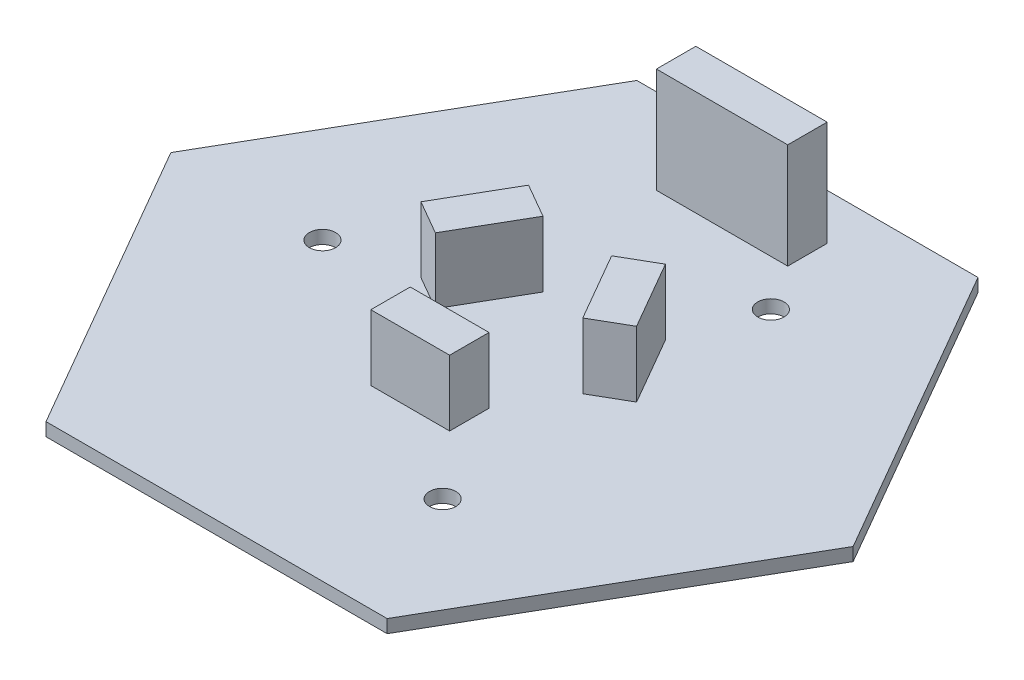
ISO-10303-21;
HEADER;
FILE_DESCRIPTION(('STEP AP214'),'2;1');
FILE_NAME('part.step','',(''),(''),'','','');
FILE_SCHEMA(('AUTOMOTIVE_DESIGN { 1 0 10303 214 1 1 1 1 }'));
ENDSEC;
DATA;
#1=APPLICATION_CONTEXT('core data for automotive mechanical design processes');
#2=APPLICATION_PROTOCOL_DEFINITION('international standard','automotive_design',2000,#1);
#3=PRODUCT_CONTEXT('',#1,'mechanical');
#4=PRODUCT('Part','Part','',(#3));
#5=PRODUCT_RELATED_PRODUCT_CATEGORY('part','',(#4));
#6=PRODUCT_DEFINITION_FORMATION('','',#4);
#7=PRODUCT_DEFINITION_CONTEXT('part definition',#1,'design');
#8=PRODUCT_DEFINITION('design','',#6,#7);
#9=PRODUCT_DEFINITION_SHAPE('','',#8);
#10=(LENGTH_UNIT() NAMED_UNIT(*) SI_UNIT(.MILLI.,.METRE.));
#11=(NAMED_UNIT(*) PLANE_ANGLE_UNIT() SI_UNIT($,.RADIAN.));
#12=(NAMED_UNIT(*) SI_UNIT($,.STERADIAN.) SOLID_ANGLE_UNIT());
#13=UNCERTAINTY_MEASURE_WITH_UNIT(LENGTH_MEASURE(1.E-05),#10,'distance_accuracy_value','');
#14=(GEOMETRIC_REPRESENTATION_CONTEXT(3) GLOBAL_UNCERTAINTY_ASSIGNED_CONTEXT((#13)) GLOBAL_UNIT_ASSIGNED_CONTEXT((#10,
#11,#12)) REPRESENTATION_CONTEXT('',''));
#15=CARTESIAN_POINT('',(0.,0.,0.));
#16=DIRECTION('',(0.,0.,1.));
#17=DIRECTION('',(1.,0.,0.));
#18=AXIS2_PLACEMENT_3D('',#15,#16,#17);
#19=CARTESIAN_POINT('',(0.,1.,0.));
#20=DIRECTION('',(0.,1.,0.));
#21=DIRECTION('',(0.,0.,1.));
#22=AXIS2_PLACEMENT_3D('',#19,#20,#21);
#23=PLANE('',#22);
#24=CARTESIAN_POINT('',(7.21687836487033,1.,12.5));
#25=DIRECTION('',(0.,1.,0.));
#26=DIRECTION('',(0.,0.,1.));
#27=AXIS2_PLACEMENT_3D('',#24,#25,#26);
#28=CIRCLE('',#27,0.999999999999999);
#29=CARTESIAN_POINT('',(7.21687836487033,1.,13.5));
#30=VERTEX_POINT('',#29);
#31=EDGE_CURVE('E356',#30,#30,#28,.T.);
#32=ORIENTED_EDGE('',*,*,#31,.F.);
#33=EDGE_LOOP('',(#32));
#34=FACE_BOUND('',#33,.T.);
#35=DIRECTION('',(0.499999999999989,0.,-0.866025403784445));
#36=VECTOR('',#35,1.);
#37=CARTESIAN_POINT('',(22.4855715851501,1.,6.05384757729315));
#38=LINE('',#37,#36);
#39=CARTESIAN_POINT('',(12.9903810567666,1.,22.5));
#40=VERTEX_POINT('',#39);
#41=CARTESIAN_POINT('',(25.9807621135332,1.,0.));
#42=VERTEX_POINT('',#41);
#43=EDGE_CURVE('E372',#40,#42,#38,.T.);
#44=ORIENTED_EDGE('',*,*,#43,.T.);
#45=DIRECTION('',(-0.5,0.,-0.866025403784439));
#46=VECTOR('',#45,1.);
#47=CARTESIAN_POINT('',(25.9807621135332,1.,0.));
#48=LINE('',#47,#46);
#49=CARTESIAN_POINT('',(12.9903810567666,1.,-22.5));
#50=VERTEX_POINT('',#49);
#51=EDGE_CURVE('E376',#42,#50,#48,.T.);
#52=ORIENTED_EDGE('',*,*,#51,.T.);
#53=DIRECTION('',(-1.,0.,0.));
#54=VECTOR('',#53,1.);
#55=CARTESIAN_POINT('',(12.9903810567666,1.,-22.5));
#56=LINE('',#55,#54);
#57=CARTESIAN_POINT('',(-12.9903810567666,1.,-22.5));
#58=VERTEX_POINT('',#57);
#59=EDGE_CURVE('E380',#50,#58,#56,.T.);
#60=ORIENTED_EDGE('',*,*,#59,.T.);
#61=DIRECTION('',(-0.5,0.,0.866025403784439));
#62=VECTOR('',#61,1.);
#63=CARTESIAN_POINT('',(-12.9903810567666,1.,-22.5));
#64=LINE('',#63,#62);
#65=CARTESIAN_POINT('',(-25.9807621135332,1.,0.));
#66=VERTEX_POINT('',#65);
#67=EDGE_CURVE('E383',#58,#66,#64,.T.);
#68=ORIENTED_EDGE('',*,*,#67,.T.);
#69=DIRECTION('',(0.50000000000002,0.,0.866025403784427));
#70=VECTOR('',#69,1.);
#71=CARTESIAN_POINT('',(-25.9807621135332,1.,0.));
#72=LINE('',#71,#70);
#73=CARTESIAN_POINT('',(-12.9903810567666,1.,22.5));
#74=VERTEX_POINT('',#73);
#75=EDGE_CURVE('E386',#66,#74,#72,.T.);
#76=ORIENTED_EDGE('',*,*,#75,.T.);
#77=DIRECTION('',(1.,0.,0.));
#78=VECTOR('',#77,1.);
#79=CARTESIAN_POINT('',(-12.9903810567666,1.,22.5));
#80=LINE('',#79,#78);
#81=EDGE_CURVE('E389',#74,#40,#80,.T.);
#82=ORIENTED_EDGE('',*,*,#81,.T.);
#83=EDGE_LOOP('',(#44,#52,#60,#68,#76,#82));
#84=FACE_BOUND('',#83,.T.);
#85=CARTESIAN_POINT('',(7.21687836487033,1.,-12.5));
#86=DIRECTION('',(0.,1.,0.));
#87=DIRECTION('',(0.,0.,1.));
#88=AXIS2_PLACEMENT_3D('',#85,#86,#87);
#89=CIRCLE('',#88,0.999999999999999);
#90=CARTESIAN_POINT('',(7.21687836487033,1.,-11.5));
#91=VERTEX_POINT('',#90);
#92=EDGE_CURVE('E364',#91,#91,#89,.T.);
#93=ORIENTED_EDGE('',*,*,#92,.F.);
#94=EDGE_LOOP('',(#93));
#95=FACE_BOUND('',#94,.T.);
#96=CARTESIAN_POINT('',(-14.4337567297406,1.,0.));
#97=DIRECTION('',(0.,1.,0.));
#98=DIRECTION('',(0.,0.,1.));
#99=AXIS2_PLACEMENT_3D('',#96,#97,#98);
#100=CIRCLE('',#99,1.);
#101=CARTESIAN_POINT('',(-14.4337567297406,1.,0.999999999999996));
#102=VERTEX_POINT('',#101);
#103=EDGE_CURVE('E348',#102,#102,#100,.T.);
#104=ORIENTED_EDGE('',*,*,#103,.F.);
#105=EDGE_LOOP('',(#104));
#106=FACE_BOUND('',#105,.T.);
#107=DIRECTION('',(-0.5,0.,-0.866025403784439));
#108=VECTOR('',#107,1.);
#109=CARTESIAN_POINT('',(8.21169687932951,1.,-1.27692378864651));
#110=LINE('',#109,#108);
#111=CARTESIAN_POINT('',(8.21169687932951,1.,-1.27692378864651));
#112=VERTEX_POINT('',#111);
#113=CARTESIAN_POINT('',(5.21169687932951,1.,-6.47307621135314));
#114=VERTEX_POINT('',#113);
#115=EDGE_CURVE('E325',#112,#114,#110,.T.);
#116=ORIENTED_EDGE('',*,*,#115,.F.);
#117=DIRECTION('',(0.866025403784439,0.,-0.5));
#118=VECTOR('',#117,1.);
#119=CARTESIAN_POINT('',(5.61362066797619,1.,0.223076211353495));
#120=LINE('',#119,#118);
#121=CARTESIAN_POINT('',(5.61362066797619,1.,0.223076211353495));
#122=VERTEX_POINT('',#121);
#123=EDGE_CURVE('E306',#122,#112,#120,.T.);
#124=ORIENTED_EDGE('',*,*,#123,.F.);
#125=DIRECTION('',(0.499999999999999,0.,0.866025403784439));
#126=VECTOR('',#125,1.);
#127=CARTESIAN_POINT('',(5.61362066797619,1.,0.223076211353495));
#128=LINE('',#127,#126);
#129=CARTESIAN_POINT('',(2.6136206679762,1.,-4.97307621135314));
#130=VERTEX_POINT('',#129);
#131=EDGE_CURVE('E312',#130,#122,#128,.T.);
#132=ORIENTED_EDGE('',*,*,#131,.F.);
#133=DIRECTION('',(-0.866025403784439,0.,0.5));
#134=VECTOR('',#133,1.);
#135=CARTESIAN_POINT('',(2.6136206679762,1.,-4.97307621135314));
#136=LINE('',#135,#134);
#137=EDGE_CURVE('E328',#114,#130,#136,.T.);
#138=ORIENTED_EDGE('',*,*,#137,.F.);
#139=EDGE_LOOP('',(#116,#124,#132,#138));
#140=FACE_BOUND('',#139,.T.);
#141=DIRECTION('',(0.,0.,1.));
#142=VECTOR('',#141,1.);
#143=CARTESIAN_POINT('',(-3.00000000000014,1.,4.75000000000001));
#144=LINE('',#143,#142);
#145=CARTESIAN_POINT('',(-3.00000000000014,1.,4.75000000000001));
#146=VERTEX_POINT('',#145);
#147=CARTESIAN_POINT('',(-3.00000000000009,1.,7.75000000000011));
#148=VERTEX_POINT('',#147);
#149=EDGE_CURVE('E284',#146,#148,#144,.T.);
#150=ORIENTED_EDGE('',*,*,#149,.F.);
#151=DIRECTION('',(-1.,0.,0.));
#152=VECTOR('',#151,1.);
#153=CARTESIAN_POINT('',(-3.00000000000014,1.,4.75000000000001));
#154=LINE('',#153,#152);
#155=CARTESIAN_POINT('',(2.99999999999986,1.,4.75000000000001));
#156=VERTEX_POINT('',#155);
#157=EDGE_CURVE('E265',#156,#146,#154,.T.);
#158=ORIENTED_EDGE('',*,*,#157,.F.);
#159=DIRECTION('',(0.,0.,-1.));
#160=VECTOR('',#159,1.);
#161=CARTESIAN_POINT('',(2.99999999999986,1.,4.75000000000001));
#162=LINE('',#161,#160);
#163=CARTESIAN_POINT('',(2.99999999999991,1.,7.75000000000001));
#164=VERTEX_POINT('',#163);
#165=EDGE_CURVE('E271',#164,#156,#162,.T.);
#166=ORIENTED_EDGE('',*,*,#165,.F.);
#167=DIRECTION('',(1.,0.,0.));
#168=VECTOR('',#167,1.);
#169=CARTESIAN_POINT('',(-3.00000000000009,1.,7.75000000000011));
#170=LINE('',#169,#168);
#171=EDGE_CURVE('E287',#148,#164,#170,.T.);
#172=ORIENTED_EDGE('',*,*,#171,.F.);
#173=EDGE_LOOP('',(#150,#158,#166,#172));
#174=FACE_BOUND('',#173,.T.);
#175=DIRECTION('',(-0.866025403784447,0.,-0.499999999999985));
#176=VECTOR('',#175,1.);
#177=CARTESIAN_POINT('',(-2.61362066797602,1.,-4.97307621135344));
#178=LINE('',#177,#176);
#179=CARTESIAN_POINT('',(-2.61362066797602,1.,-4.97307621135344));
#180=VERTEX_POINT('',#179);
#181=CARTESIAN_POINT('',(-5.21169687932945,1.,-6.47307621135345));
#182=VERTEX_POINT('',#181);
#183=EDGE_CURVE('E223',#180,#182,#178,.T.);
#184=ORIENTED_EDGE('',*,*,#183,.F.);
#185=DIRECTION('',(0.499999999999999,0.,-0.866025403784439));
#186=VECTOR('',#185,1.);
#187=CARTESIAN_POINT('',(-2.61362066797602,1.,-4.97307621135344));
#188=LINE('',#187,#186);
#189=CARTESIAN_POINT('',(-5.61362066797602,1.,0.223076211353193));
#190=VERTEX_POINT('',#189);
#191=EDGE_CURVE('E218',#190,#180,#188,.T.);
#192=ORIENTED_EDGE('',*,*,#191,.F.);
#193=DIRECTION('',(0.866025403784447,0.,0.499999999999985));
#194=VECTOR('',#193,1.);
#195=CARTESIAN_POINT('',(-5.61362066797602,1.,0.223076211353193));
#196=LINE('',#195,#194);
#197=CARTESIAN_POINT('',(-8.21169687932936,1.,-1.27692378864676));
#198=VERTEX_POINT('',#197);
#199=EDGE_CURVE('E234',#198,#190,#196,.T.);
#200=ORIENTED_EDGE('',*,*,#199,.F.);
#201=DIRECTION('',(-0.499999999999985,0.,0.866025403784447));
#202=VECTOR('',#201,1.);
#203=CARTESIAN_POINT('',(-5.21169687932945,1.,-6.47307621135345));
#204=LINE('',#203,#202);
#205=EDGE_CURVE('E246',#182,#198,#204,.T.);
#206=ORIENTED_EDGE('',*,*,#205,.F.);
#207=EDGE_LOOP('',(#184,#192,#200,#206));
#208=FACE_BOUND('',#207,.T.);
#209=DIRECTION('',(1.,0.,0.));
#210=VECTOR('',#209,1.);
#211=CARTESIAN_POINT('',(0.,1.,-16.));
#212=LINE('',#211,#210);
#213=CARTESIAN_POINT('',(-5.,1.,-16.));
#214=VERTEX_POINT('',#213);
#215=CARTESIAN_POINT('',(5.,1.,-16.));
#216=VERTEX_POINT('',#215);
#217=EDGE_CURVE('E59',#214,#216,#212,.T.);
#218=ORIENTED_EDGE('',*,*,#217,.F.);
#219=DIRECTION('',(0.,0.,1.));
#220=VECTOR('',#219,1.);
#221=CARTESIAN_POINT('',(-5.,1.,0.));
#222=LINE('',#221,#220);
#223=CARTESIAN_POINT('',(-5.,1.,-19.));
#224=VERTEX_POINT('',#223);
#225=EDGE_CURVE('E216',#224,#214,#222,.T.);
#226=ORIENTED_EDGE('',*,*,#225,.F.);
#227=DIRECTION('',(1.,0.,0.));
#228=VECTOR('',#227,1.);
#229=CARTESIAN_POINT('',(0.,1.,-19.));
#230=LINE('',#229,#228);
#231=CARTESIAN_POINT('',(5.,1.,-19.));
#232=VERTEX_POINT('',#231);
#233=EDGE_CURVE('E213',#224,#232,#230,.T.);
#234=ORIENTED_EDGE('',*,*,#233,.T.);
#235=DIRECTION('',(0.,0.,1.));
#236=VECTOR('',#235,1.);
#237=CARTESIAN_POINT('',(5.00000000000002,1.,0.));
#238=LINE('',#237,#236);
#239=EDGE_CURVE('E64',#232,#216,#238,.T.);
#240=ORIENTED_EDGE('',*,*,#239,.T.);
#241=EDGE_LOOP('',(#218,#226,#234,#240));
#242=FACE_BOUND('',#241,.T.);
#243=ADVANCED_FACE('F43',(#34,#84,#95,#106,#140,#174,#208,#242),#23,.T.);
#244=CARTESIAN_POINT('',(0.,0.,0.));
#245=DIRECTION('',(0.,1.,0.));
#246=DIRECTION('',(0.,0.,1.));
#247=AXIS2_PLACEMENT_3D('',#244,#245,#246);
#248=PLANE('',#247);
#249=DIRECTION('',(-0.5,0.,-0.866025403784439));
#250=VECTOR('',#249,1.);
#251=CARTESIAN_POINT('',(25.9807621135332,0.,0.));
#252=LINE('',#251,#250);
#253=CARTESIAN_POINT('',(25.9807621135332,0.,0.));
#254=VERTEX_POINT('',#253);
#255=CARTESIAN_POINT('',(12.9903810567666,0.,-22.5));
#256=VERTEX_POINT('',#255);
#257=EDGE_CURVE('E368',#254,#256,#252,.T.);
#258=ORIENTED_EDGE('',*,*,#257,.F.);
#259=DIRECTION('',(0.500000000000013,0.,-0.866025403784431));
#260=VECTOR('',#259,1.);
#261=CARTESIAN_POINT('',(19.4855715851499,0.,11.25));
#262=LINE('',#261,#260);
#263=CARTESIAN_POINT('',(12.9903810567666,0.,22.5));
#264=VERTEX_POINT('',#263);
#265=EDGE_CURVE('E377',#264,#254,#262,.T.);
#266=ORIENTED_EDGE('',*,*,#265,.F.);
#267=DIRECTION('',(1.,0.,0.));
#268=VECTOR('',#267,1.);
#269=CARTESIAN_POINT('',(-12.9903810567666,0.,22.5));
#270=LINE('',#269,#268);
#271=CARTESIAN_POINT('',(-12.9903810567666,0.,22.5));
#272=VERTEX_POINT('',#271);
#273=EDGE_CURVE('E407',#272,#264,#270,.T.);
#274=ORIENTED_EDGE('',*,*,#273,.F.);
#275=DIRECTION('',(0.499999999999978,0.,0.866025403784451));
#276=VECTOR('',#275,1.);
#277=CARTESIAN_POINT('',(-16.4855715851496,0.,16.4461524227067));
#278=LINE('',#277,#276);
#279=CARTESIAN_POINT('',(-25.9807621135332,0.,0.));
#280=VERTEX_POINT('',#279);
#281=EDGE_CURVE('E404',#280,#272,#278,.T.);
#282=ORIENTED_EDGE('',*,*,#281,.F.);
#283=DIRECTION('',(-0.5,0.,0.866025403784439));
#284=VECTOR('',#283,1.);
#285=CARTESIAN_POINT('',(-12.9903810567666,0.,-22.5));
#286=LINE('',#285,#284);
#287=CARTESIAN_POINT('',(-12.9903810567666,0.,-22.5));
#288=VERTEX_POINT('',#287);
#289=EDGE_CURVE('E400',#288,#280,#286,.T.);
#290=ORIENTED_EDGE('',*,*,#289,.F.);
#291=DIRECTION('',(-1.,0.,0.));
#292=VECTOR('',#291,1.);
#293=CARTESIAN_POINT('',(-6.,0.,-22.5));
#294=LINE('',#293,#292);
#295=EDGE_CURVE('E397',#256,#288,#294,.T.);
#296=ORIENTED_EDGE('',*,*,#295,.F.);
#297=EDGE_LOOP('',(#258,#266,#274,#282,#290,#296));
#298=FACE_BOUND('',#297,.T.);
#299=CARTESIAN_POINT('',(7.21687836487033,0.,-12.5));
#300=DIRECTION('',(0.,1.,0.));
#301=DIRECTION('',(0.,0.,1.));
#302=AXIS2_PLACEMENT_3D('',#299,#300,#301);
#303=CIRCLE('',#302,0.999999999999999);
#304=CARTESIAN_POINT('',(7.21687836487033,0.,-11.5));
#305=VERTEX_POINT('',#304);
#306=EDGE_CURVE('E360',#305,#305,#303,.T.);
#307=ORIENTED_EDGE('',*,*,#306,.T.);
#308=EDGE_LOOP('',(#307));
#309=FACE_BOUND('',#308,.T.);
#310=CARTESIAN_POINT('',(7.21687836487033,0.,12.5));
#311=DIRECTION('',(0.,1.,0.));
#312=DIRECTION('',(0.,0.,1.));
#313=AXIS2_PLACEMENT_3D('',#310,#311,#312);
#314=CIRCLE('',#313,0.999999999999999);
#315=CARTESIAN_POINT('',(7.21687836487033,0.,13.5));
#316=VERTEX_POINT('',#315);
#317=EDGE_CURVE('E352',#316,#316,#314,.T.);
#318=ORIENTED_EDGE('',*,*,#317,.T.);
#319=EDGE_LOOP('',(#318));
#320=FACE_BOUND('',#319,.T.);
#321=CARTESIAN_POINT('',(-14.4337567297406,0.,0.));
#322=DIRECTION('',(0.,1.,0.));
#323=DIRECTION('',(0.,0.,1.));
#324=AXIS2_PLACEMENT_3D('',#321,#322,#323);
#325=CIRCLE('',#324,1.);
#326=CARTESIAN_POINT('',(-14.4337567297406,0.,0.999999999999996));
#327=VERTEX_POINT('',#326);
#328=EDGE_CURVE('E347',#327,#327,#325,.T.);
#329=ORIENTED_EDGE('',*,*,#328,.T.);
#330=EDGE_LOOP('',(#329));
#331=FACE_BOUND('',#330,.T.);
#332=ADVANCED_FACE('F438',(#298,#309,#320,#331),#248,.F.);
#333=CARTESIAN_POINT('',(25.9807621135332,1.,0.));
#334=DIRECTION('',(-0.866025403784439,0.,0.5));
#335=DIRECTION('',(0.5,0.,0.866025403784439));
#336=AXIS2_PLACEMENT_3D('',#333,#334,#335);
#337=PLANE('',#336);
#338=ORIENTED_EDGE('',*,*,#257,.T.);
#339=DIRECTION('',(0.,-1.,0.));
#340=VECTOR('',#339,1.);
#341=CARTESIAN_POINT('',(12.9903810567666,1.,-22.5));
#342=LINE('',#341,#340);
#343=EDGE_CURVE('E52',#50,#256,#342,.T.);
#344=ORIENTED_EDGE('',*,*,#343,.F.);
#345=ORIENTED_EDGE('',*,*,#51,.F.);
#346=DIRECTION('',(0.,-1.,0.));
#347=VECTOR('',#346,1.);
#348=CARTESIAN_POINT('',(25.9807621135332,1.,0.));
#349=LINE('',#348,#347);
#350=EDGE_CURVE('E11',#42,#254,#349,.T.);
#351=ORIENTED_EDGE('',*,*,#350,.T.);
#352=EDGE_LOOP('',(#338,#344,#345,#351));
#353=FACE_BOUND('',#352,.T.);
#354=ADVANCED_FACE('F45',(#353),#337,.F.);
#355=CARTESIAN_POINT('',(-6.,1.,-22.5));
#356=DIRECTION('',(0.,0.,1.));
#357=DIRECTION('',(1.,0.,0.));
#358=AXIS2_PLACEMENT_3D('',#355,#356,#357);
#359=PLANE('',#358);
#360=ORIENTED_EDGE('',*,*,#295,.T.);
#361=DIRECTION('',(0.,-1.,0.));
#362=VECTOR('',#361,1.);
#363=CARTESIAN_POINT('',(-12.9903810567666,1.,-22.5));
#364=LINE('',#363,#362);
#365=EDGE_CURVE('E424',#58,#288,#364,.T.);
#366=ORIENTED_EDGE('',*,*,#365,.F.);
#367=ORIENTED_EDGE('',*,*,#59,.F.);
#368=ORIENTED_EDGE('',*,*,#343,.T.);
#369=EDGE_LOOP('',(#360,#366,#367,#368));
#370=FACE_BOUND('',#369,.T.);
#371=ADVANCED_FACE('F432',(#370),#359,.F.);
#372=CARTESIAN_POINT('',(-12.9903810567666,1.,-22.5));
#373=DIRECTION('',(0.866025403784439,0.,0.5));
#374=DIRECTION('',(0.5,0.,-0.866025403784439));
#375=AXIS2_PLACEMENT_3D('',#372,#373,#374);
#376=PLANE('',#375);
#377=ORIENTED_EDGE('',*,*,#289,.T.);
#378=DIRECTION('',(0.,-1.,0.));
#379=VECTOR('',#378,1.);
#380=CARTESIAN_POINT('',(-25.9807621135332,1.,0.));
#381=LINE('',#380,#379);
#382=EDGE_CURVE('E420',#66,#280,#381,.T.);
#383=ORIENTED_EDGE('',*,*,#382,.F.);
#384=ORIENTED_EDGE('',*,*,#67,.F.);
#385=ORIENTED_EDGE('',*,*,#365,.T.);
#386=EDGE_LOOP('',(#377,#383,#384,#385));
#387=FACE_BOUND('',#386,.T.);
#388=ADVANCED_FACE('F444',(#387),#376,.F.);
#389=CARTESIAN_POINT('',(-16.4855715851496,1.,16.4461524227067));
#390=DIRECTION('',(0.866025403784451,0.,-0.499999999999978));
#391=DIRECTION('',(-0.499999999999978,0.,-0.866025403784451));
#392=AXIS2_PLACEMENT_3D('',#389,#390,#391);
#393=PLANE('',#392);
#394=ORIENTED_EDGE('',*,*,#281,.T.);
#395=DIRECTION('',(0.,-1.,0.));
#396=VECTOR('',#395,1.);
#397=CARTESIAN_POINT('',(-12.9903810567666,1.,22.5));
#398=LINE('',#397,#396);
#399=EDGE_CURVE('E416',#74,#272,#398,.T.);
#400=ORIENTED_EDGE('',*,*,#399,.F.);
#401=ORIENTED_EDGE('',*,*,#75,.F.);
#402=ORIENTED_EDGE('',*,*,#382,.T.);
#403=EDGE_LOOP('',(#394,#400,#401,#402));
#404=FACE_BOUND('',#403,.T.);
#405=ADVANCED_FACE('F448',(#404),#393,.F.);
#406=CARTESIAN_POINT('',(-12.9903810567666,1.,22.5));
#407=DIRECTION('',(0.,0.,-1.));
#408=DIRECTION('',(-1.,0.,0.));
#409=AXIS2_PLACEMENT_3D('',#406,#407,#408);
#410=PLANE('',#409);
#411=ORIENTED_EDGE('',*,*,#273,.T.);
#412=DIRECTION('',(0.,-1.,0.));
#413=VECTOR('',#412,1.);
#414=CARTESIAN_POINT('',(12.9903810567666,1.,22.5));
#415=LINE('',#414,#413);
#416=EDGE_CURVE('E393',#40,#264,#415,.T.);
#417=ORIENTED_EDGE('',*,*,#416,.F.);
#418=ORIENTED_EDGE('',*,*,#81,.F.);
#419=ORIENTED_EDGE('',*,*,#399,.T.);
#420=EDGE_LOOP('',(#411,#417,#418,#419));
#421=FACE_BOUND('',#420,.T.);
#422=ADVANCED_FACE('F457',(#421),#410,.F.);
#423=CARTESIAN_POINT('',(19.4855715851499,1.,11.25));
#424=DIRECTION('',(-0.866025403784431,0.,-0.500000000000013));
#425=DIRECTION('',(-0.500000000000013,0.,0.866025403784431));
#426=AXIS2_PLACEMENT_3D('',#423,#424,#425);
#427=PLANE('',#426);
#428=ORIENTED_EDGE('',*,*,#265,.T.);
#429=ORIENTED_EDGE('',*,*,#350,.F.);
#430=ORIENTED_EDGE('',*,*,#43,.F.);
#431=ORIENTED_EDGE('',*,*,#416,.T.);
#432=EDGE_LOOP('',(#428,#429,#430,#431));
#433=FACE_BOUND('',#432,.T.);
#434=ADVANCED_FACE('F455',(#433),#427,.F.);
#435=CARTESIAN_POINT('',(7.21687836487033,1.,-12.5));
#436=DIRECTION('',(0.,-1.,0.));
#437=DIRECTION('',(0.,0.,-1.));
#438=AXIS2_PLACEMENT_3D('',#435,#436,#437);
#439=CYLINDRICAL_SURFACE('',#438,0.999999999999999);
#440=ORIENTED_EDGE('',*,*,#92,.T.);
#441=EDGE_LOOP('',(#440));
#442=FACE_BOUND('',#441,.T.);
#443=ORIENTED_EDGE('',*,*,#306,.F.);
#444=EDGE_LOOP('',(#443));
#445=FACE_BOUND('',#444,.T.);
#446=ADVANCED_FACE('F464',(#442,#445),#439,.F.);
#447=CARTESIAN_POINT('',(7.21687836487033,1.,12.5));
#448=DIRECTION('',(0.,-1.,0.));
#449=DIRECTION('',(0.,0.,-1.));
#450=AXIS2_PLACEMENT_3D('',#447,#448,#449);
#451=CYLINDRICAL_SURFACE('',#450,0.999999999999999);
#452=ORIENTED_EDGE('',*,*,#31,.T.);
#453=EDGE_LOOP('',(#452));
#454=FACE_BOUND('',#453,.T.);
#455=ORIENTED_EDGE('',*,*,#317,.F.);
#456=EDGE_LOOP('',(#455));
#457=FACE_BOUND('',#456,.T.);
#458=ADVANCED_FACE('F478',(#454,#457),#451,.F.);
#459=CARTESIAN_POINT('',(-14.4337567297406,1.,0.));
#460=DIRECTION('',(0.,-1.,0.));
#461=DIRECTION('',(0.,0.,-1.));
#462=AXIS2_PLACEMENT_3D('',#459,#460,#461);
#463=CYLINDRICAL_SURFACE('',#462,1.);
#464=ORIENTED_EDGE('',*,*,#103,.T.);
#465=EDGE_LOOP('',(#464));
#466=FACE_BOUND('',#465,.T.);
#467=ORIENTED_EDGE('',*,*,#328,.F.);
#468=EDGE_LOOP('',(#467));
#469=FACE_BOUND('',#468,.T.);
#470=ADVANCED_FACE('F482',(#466,#469),#463,.F.);
#471=CARTESIAN_POINT('',(5.61362066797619,6.,0.223076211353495));
#472=DIRECTION('',(-0.5,0.,-0.866025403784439));
#473=DIRECTION('',(-0.866025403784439,0.,0.5));
#474=AXIS2_PLACEMENT_3D('',#471,#472,#473);
#475=PLANE('',#474);
#476=ORIENTED_EDGE('',*,*,#123,.T.);
#477=DIRECTION('',(0.,-1.,0.));
#478=VECTOR('',#477,1.);
#479=CARTESIAN_POINT('',(8.21169687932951,6.,-1.27692378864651));
#480=LINE('',#479,#478);
#481=CARTESIAN_POINT('',(8.21169687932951,6.,-1.27692378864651));
#482=VERTEX_POINT('',#481);
#483=EDGE_CURVE('E344',#482,#112,#480,.T.);
#484=ORIENTED_EDGE('',*,*,#483,.F.);
#485=DIRECTION('',(0.866025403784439,0.,-0.5));
#486=VECTOR('',#485,1.);
#487=CARTESIAN_POINT('',(5.61362066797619,6.,0.223076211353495));
#488=LINE('',#487,#486);
#489=CARTESIAN_POINT('',(5.61362066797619,6.,0.223076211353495));
#490=VERTEX_POINT('',#489);
#491=EDGE_CURVE('E307',#490,#482,#488,.T.);
#492=ORIENTED_EDGE('',*,*,#491,.F.);
#493=DIRECTION('',(0.,-1.,0.));
#494=VECTOR('',#493,1.);
#495=CARTESIAN_POINT('',(5.61362066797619,6.,0.223076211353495));
#496=LINE('',#495,#494);
#497=EDGE_CURVE('E321',#490,#122,#496,.T.);
#498=ORIENTED_EDGE('',*,*,#497,.T.);
#499=EDGE_LOOP('',(#476,#484,#492,#498));
#500=FACE_BOUND('',#499,.T.);
#501=ADVANCED_FACE('F486',(#500),#475,.F.);
#502=CARTESIAN_POINT('',(8.21169687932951,6.,-1.27692378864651));
#503=DIRECTION('',(-0.866025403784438,0.,0.5));
#504=DIRECTION('',(0.5,0.,0.866025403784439));
#505=AXIS2_PLACEMENT_3D('',#502,#503,#504);
#506=PLANE('',#505);
#507=ORIENTED_EDGE('',*,*,#115,.T.);
#508=DIRECTION('',(0.,-1.,0.));
#509=VECTOR('',#508,1.);
#510=CARTESIAN_POINT('',(5.21169687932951,6.,-6.47307621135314));
#511=LINE('',#510,#509);
#512=CARTESIAN_POINT('',(5.21169687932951,6.,-6.47307621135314));
#513=VERTEX_POINT('',#512);
#514=EDGE_CURVE('E340',#513,#114,#511,.T.);
#515=ORIENTED_EDGE('',*,*,#514,.F.);
#516=DIRECTION('',(-0.5,0.,-0.866025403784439));
#517=VECTOR('',#516,1.);
#518=CARTESIAN_POINT('',(8.21169687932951,6.,-1.27692378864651));
#519=LINE('',#518,#517);
#520=EDGE_CURVE('E311',#482,#513,#519,.T.);
#521=ORIENTED_EDGE('',*,*,#520,.F.);
#522=ORIENTED_EDGE('',*,*,#483,.T.);
#523=EDGE_LOOP('',(#507,#515,#521,#522));
#524=FACE_BOUND('',#523,.T.);
#525=ADVANCED_FACE('F490',(#524),#506,.F.);
#526=CARTESIAN_POINT('',(2.6136206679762,6.,-4.97307621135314));
#527=DIRECTION('',(0.5,0.,0.866025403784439));
#528=DIRECTION('',(0.866025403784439,0.,-0.5));
#529=AXIS2_PLACEMENT_3D('',#526,#527,#528);
#530=PLANE('',#529);
#531=ORIENTED_EDGE('',*,*,#137,.T.);
#532=DIRECTION('',(0.,-1.,0.));
#533=VECTOR('',#532,1.);
#534=CARTESIAN_POINT('',(2.6136206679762,6.,-4.97307621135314));
#535=LINE('',#534,#533);
#536=CARTESIAN_POINT('',(2.6136206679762,6.,-4.97307621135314));
#537=VERTEX_POINT('',#536);
#538=EDGE_CURVE('E337',#537,#130,#535,.T.);
#539=ORIENTED_EDGE('',*,*,#538,.F.);
#540=DIRECTION('',(-0.866025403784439,0.,0.5));
#541=VECTOR('',#540,1.);
#542=CARTESIAN_POINT('',(2.6136206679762,6.,-4.97307621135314));
#543=LINE('',#542,#541);
#544=EDGE_CURVE('E315',#513,#537,#543,.T.);
#545=ORIENTED_EDGE('',*,*,#544,.F.);
#546=ORIENTED_EDGE('',*,*,#514,.T.);
#547=EDGE_LOOP('',(#531,#539,#545,#546));
#548=FACE_BOUND('',#547,.T.);
#549=ADVANCED_FACE('F494',(#548),#530,.F.);
#550=CARTESIAN_POINT('',(5.61362066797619,6.,0.223076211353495));
#551=DIRECTION('',(0.866025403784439,0.,-0.499999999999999));
#552=DIRECTION('',(-0.499999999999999,0.,-0.866025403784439));
#553=AXIS2_PLACEMENT_3D('',#550,#551,#552);
#554=PLANE('',#553);
#555=ORIENTED_EDGE('',*,*,#131,.T.);
#556=ORIENTED_EDGE('',*,*,#497,.F.);
#557=DIRECTION('',(0.499999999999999,0.,0.866025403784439));
#558=VECTOR('',#557,1.);
#559=CARTESIAN_POINT('',(5.61362066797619,6.,0.223076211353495));
#560=LINE('',#559,#558);
#561=EDGE_CURVE('E318',#537,#490,#560,.T.);
#562=ORIENTED_EDGE('',*,*,#561,.F.);
#563=ORIENTED_EDGE('',*,*,#538,.T.);
#564=EDGE_LOOP('',(#555,#556,#562,#563));
#565=FACE_BOUND('',#564,.T.);
#566=ADVANCED_FACE('F498',(#565),#554,.F.);
#567=CARTESIAN_POINT('',(0.,6.,0.));
#568=DIRECTION('',(0.,1.,0.));
#569=DIRECTION('',(0.,0.,1.));
#570=AXIS2_PLACEMENT_3D('',#567,#568,#569);
#571=PLANE('',#570);
#572=ORIENTED_EDGE('',*,*,#491,.T.);
#573=ORIENTED_EDGE('',*,*,#520,.T.);
#574=ORIENTED_EDGE('',*,*,#544,.T.);
#575=ORIENTED_EDGE('',*,*,#561,.T.);
#576=EDGE_LOOP('',(#572,#573,#574,#575));
#577=FACE_BOUND('',#576,.T.);
#578=ADVANCED_FACE('F502',(#577),#571,.T.);
#579=CARTESIAN_POINT('',(-3.00000000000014,6.,4.75000000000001));
#580=DIRECTION('',(0.,0.,1.));
#581=DIRECTION('',(1.,0.,0.));
#582=AXIS2_PLACEMENT_3D('',#579,#580,#581);
#583=PLANE('',#582);
#584=ORIENTED_EDGE('',*,*,#157,.T.);
#585=DIRECTION('',(0.,-1.,0.));
#586=VECTOR('',#585,1.);
#587=CARTESIAN_POINT('',(-3.00000000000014,6.,4.75000000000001));
#588=LINE('',#587,#586);
#589=CARTESIAN_POINT('',(-3.00000000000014,6.,4.75000000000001));
#590=VERTEX_POINT('',#589);
#591=EDGE_CURVE('E303',#590,#146,#588,.T.);
#592=ORIENTED_EDGE('',*,*,#591,.F.);
#593=DIRECTION('',(-1.,0.,0.));
#594=VECTOR('',#593,1.);
#595=CARTESIAN_POINT('',(-3.00000000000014,6.,4.75000000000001));
#596=LINE('',#595,#594);
#597=CARTESIAN_POINT('',(2.99999999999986,6.,4.75000000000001));
#598=VERTEX_POINT('',#597);
#599=EDGE_CURVE('E266',#598,#590,#596,.T.);
#600=ORIENTED_EDGE('',*,*,#599,.F.);
#601=DIRECTION('',(0.,-1.,0.));
#602=VECTOR('',#601,1.);
#603=CARTESIAN_POINT('',(2.99999999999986,6.,4.75000000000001));
#604=LINE('',#603,#602);
#605=EDGE_CURVE('E280',#598,#156,#604,.T.);
#606=ORIENTED_EDGE('',*,*,#605,.T.);
#607=EDGE_LOOP('',(#584,#592,#600,#606));
#608=FACE_BOUND('',#607,.T.);
#609=ADVANCED_FACE('F506',(#608),#583,.F.);
#610=CARTESIAN_POINT('',(-3.00000000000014,6.,4.75000000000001));
#611=DIRECTION('',(1.,0.,0.));
#612=DIRECTION('',(0.,0.,-1.));
#613=AXIS2_PLACEMENT_3D('',#610,#611,#612);
#614=PLANE('',#613);
#615=ORIENTED_EDGE('',*,*,#149,.T.);
#616=DIRECTION('',(0.,-1.,0.));
#617=VECTOR('',#616,1.);
#618=CARTESIAN_POINT('',(-3.00000000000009,6.,7.75000000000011));
#619=LINE('',#618,#617);
#620=CARTESIAN_POINT('',(-3.00000000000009,6.,7.75000000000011));
#621=VERTEX_POINT('',#620);
#622=EDGE_CURVE('E299',#621,#148,#619,.T.);
#623=ORIENTED_EDGE('',*,*,#622,.F.);
#624=DIRECTION('',(0.,0.,1.));
#625=VECTOR('',#624,1.);
#626=CARTESIAN_POINT('',(-3.00000000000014,6.,4.75000000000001));
#627=LINE('',#626,#625);
#628=EDGE_CURVE('E270',#590,#621,#627,.T.);
#629=ORIENTED_EDGE('',*,*,#628,.F.);
#630=ORIENTED_EDGE('',*,*,#591,.T.);
#631=EDGE_LOOP('',(#615,#623,#629,#630));
#632=FACE_BOUND('',#631,.T.);
#633=ADVANCED_FACE('F510',(#632),#614,.F.);
#634=CARTESIAN_POINT('',(-3.00000000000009,6.,7.75000000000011));
#635=DIRECTION('',(0.,0.,-1.));
#636=DIRECTION('',(-1.,0.,0.));
#637=AXIS2_PLACEMENT_3D('',#634,#635,#636);
#638=PLANE('',#637);
#639=ORIENTED_EDGE('',*,*,#171,.T.);
#640=DIRECTION('',(0.,-1.,0.));
#641=VECTOR('',#640,1.);
#642=CARTESIAN_POINT('',(2.99999999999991,6.,7.75000000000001));
#643=LINE('',#642,#641);
#644=CARTESIAN_POINT('',(2.99999999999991,6.,7.75000000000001));
#645=VERTEX_POINT('',#644);
#646=EDGE_CURVE('E296',#645,#164,#643,.T.);
#647=ORIENTED_EDGE('',*,*,#646,.F.);
#648=DIRECTION('',(1.,0.,0.));
#649=VECTOR('',#648,1.);
#650=CARTESIAN_POINT('',(-3.00000000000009,6.,7.75000000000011));
#651=LINE('',#650,#649);
#652=EDGE_CURVE('E274',#621,#645,#651,.T.);
#653=ORIENTED_EDGE('',*,*,#652,.F.);
#654=ORIENTED_EDGE('',*,*,#622,.T.);
#655=EDGE_LOOP('',(#639,#647,#653,#654));
#656=FACE_BOUND('',#655,.T.);
#657=ADVANCED_FACE('F514',(#656),#638,.F.);
#658=CARTESIAN_POINT('',(2.99999999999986,6.,4.75000000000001));
#659=DIRECTION('',(-1.,0.,0.));
#660=DIRECTION('',(0.,0.,1.));
#661=AXIS2_PLACEMENT_3D('',#658,#659,#660);
#662=PLANE('',#661);
#663=ORIENTED_EDGE('',*,*,#165,.T.);
#664=ORIENTED_EDGE('',*,*,#605,.F.);
#665=DIRECTION('',(0.,0.,-1.));
#666=VECTOR('',#665,1.);
#667=CARTESIAN_POINT('',(2.99999999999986,6.,4.75000000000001));
#668=LINE('',#667,#666);
#669=EDGE_CURVE('E277',#645,#598,#668,.T.);
#670=ORIENTED_EDGE('',*,*,#669,.F.);
#671=ORIENTED_EDGE('',*,*,#646,.T.);
#672=EDGE_LOOP('',(#663,#664,#670,#671));
#673=FACE_BOUND('',#672,.T.);
#674=ADVANCED_FACE('F518',(#673),#662,.F.);
#675=CARTESIAN_POINT('',(0.,6.,0.));
#676=DIRECTION('',(0.,-1.,0.));
#677=DIRECTION('',(0.,0.,-1.));
#678=AXIS2_PLACEMENT_3D('',#675,#676,#677);
#679=PLANE('',#678);
#680=ORIENTED_EDGE('',*,*,#599,.T.);
#681=ORIENTED_EDGE('',*,*,#628,.T.);
#682=ORIENTED_EDGE('',*,*,#652,.T.);
#683=ORIENTED_EDGE('',*,*,#669,.T.);
#684=EDGE_LOOP('',(#680,#681,#682,#683));
#685=FACE_BOUND('',#684,.T.);
#686=ADVANCED_FACE('F522',(#685),#679,.F.);
#687=CARTESIAN_POINT('',(-2.61362066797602,6.,-4.97307621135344));
#688=DIRECTION('',(-0.866025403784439,0.,-0.499999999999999));
#689=DIRECTION('',(-0.499999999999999,0.,0.866025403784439));
#690=AXIS2_PLACEMENT_3D('',#687,#688,#689);
#691=PLANE('',#690);
#692=ORIENTED_EDGE('',*,*,#191,.T.);
#693=DIRECTION('',(0.,-1.,0.));
#694=VECTOR('',#693,1.);
#695=CARTESIAN_POINT('',(-2.61362066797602,6.,-4.97307621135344));
#696=LINE('',#695,#694);
#697=CARTESIAN_POINT('',(-2.61362066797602,6.,-4.97307621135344));
#698=VERTEX_POINT('',#697);
#699=EDGE_CURVE('E262',#698,#180,#696,.T.);
#700=ORIENTED_EDGE('',*,*,#699,.F.);
#701=DIRECTION('',(0.499999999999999,0.,-0.866025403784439));
#702=VECTOR('',#701,1.);
#703=CARTESIAN_POINT('',(-2.61362066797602,6.,-4.97307621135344));
#704=LINE('',#703,#702);
#705=CARTESIAN_POINT('',(-5.61362066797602,6.,0.223076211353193));
#706=VERTEX_POINT('',#705);
#707=EDGE_CURVE('E229',#706,#698,#704,.T.);
#708=ORIENTED_EDGE('',*,*,#707,.F.);
#709=DIRECTION('',(0.,-1.,0.));
#710=VECTOR('',#709,1.);
#711=CARTESIAN_POINT('',(-5.61362066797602,6.,0.223076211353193));
#712=LINE('',#711,#710);
#713=EDGE_CURVE('E242',#706,#190,#712,.T.);
#714=ORIENTED_EDGE('',*,*,#713,.T.);
#715=EDGE_LOOP('',(#692,#700,#708,#714));
#716=FACE_BOUND('',#715,.T.);
#717=ADVANCED_FACE('F526',(#716),#691,.F.);
#718=CARTESIAN_POINT('',(-2.61362066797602,6.,-4.97307621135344));
#719=DIRECTION('',(-0.499999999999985,0.,0.866025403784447));
#720=DIRECTION('',(0.866025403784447,0.,0.499999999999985));
#721=AXIS2_PLACEMENT_3D('',#718,#719,#720);
#722=PLANE('',#721);
#723=ORIENTED_EDGE('',*,*,#183,.T.);
#724=DIRECTION('',(0.,-1.,0.));
#725=VECTOR('',#724,1.);
#726=CARTESIAN_POINT('',(-5.21169687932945,6.,-6.47307621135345));
#727=LINE('',#726,#725);
#728=CARTESIAN_POINT('',(-5.21169687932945,6.,-6.47307621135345));
#729=VERTEX_POINT('',#728);
#730=EDGE_CURVE('E258',#729,#182,#727,.T.);
#731=ORIENTED_EDGE('',*,*,#730,.F.);
#732=DIRECTION('',(-0.866025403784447,0.,-0.499999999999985));
#733=VECTOR('',#732,1.);
#734=CARTESIAN_POINT('',(-2.61362066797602,6.,-4.97307621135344));
#735=LINE('',#734,#733);
#736=EDGE_CURVE('E233',#698,#729,#735,.T.);
#737=ORIENTED_EDGE('',*,*,#736,.F.);
#738=ORIENTED_EDGE('',*,*,#699,.T.);
#739=EDGE_LOOP('',(#723,#731,#737,#738));
#740=FACE_BOUND('',#739,.T.);
#741=ADVANCED_FACE('F530',(#740),#722,.F.);
#742=CARTESIAN_POINT('',(-5.21169687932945,6.,-6.47307621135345));
#743=DIRECTION('',(0.866025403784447,0.,0.499999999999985));
#744=DIRECTION('',(0.499999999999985,0.,-0.866025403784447));
#745=AXIS2_PLACEMENT_3D('',#742,#743,#744);
#746=PLANE('',#745);
#747=ORIENTED_EDGE('',*,*,#205,.T.);
#748=DIRECTION('',(0.,-1.,0.));
#749=VECTOR('',#748,1.);
#750=CARTESIAN_POINT('',(-8.21169687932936,6.,-1.27692378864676));
#751=LINE('',#750,#749);
#752=CARTESIAN_POINT('',(-8.21169687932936,6.,-1.27692378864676));
#753=VERTEX_POINT('',#752);
#754=EDGE_CURVE('E255',#753,#198,#751,.T.);
#755=ORIENTED_EDGE('',*,*,#754,.F.);
#756=DIRECTION('',(-0.499999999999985,0.,0.866025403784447));
#757=VECTOR('',#756,1.);
#758=CARTESIAN_POINT('',(-5.21169687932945,6.,-6.47307621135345));
#759=LINE('',#758,#757);
#760=EDGE_CURVE('E237',#729,#753,#759,.T.);
#761=ORIENTED_EDGE('',*,*,#760,.F.);
#762=ORIENTED_EDGE('',*,*,#730,.T.);
#763=EDGE_LOOP('',(#747,#755,#761,#762));
#764=FACE_BOUND('',#763,.T.);
#765=ADVANCED_FACE('F534',(#764),#746,.F.);
#766=CARTESIAN_POINT('',(-5.61362066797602,6.,0.223076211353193));
#767=DIRECTION('',(0.499999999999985,0.,-0.866025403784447));
#768=DIRECTION('',(-0.866025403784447,0.,-0.499999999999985));
#769=AXIS2_PLACEMENT_3D('',#766,#767,#768);
#770=PLANE('',#769);
#771=ORIENTED_EDGE('',*,*,#199,.T.);
#772=ORIENTED_EDGE('',*,*,#713,.F.);
#773=DIRECTION('',(0.866025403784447,0.,0.499999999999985));
#774=VECTOR('',#773,1.);
#775=CARTESIAN_POINT('',(-5.61362066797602,6.,0.223076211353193));
#776=LINE('',#775,#774);
#777=EDGE_CURVE('E240',#753,#706,#776,.T.);
#778=ORIENTED_EDGE('',*,*,#777,.F.);
#779=ORIENTED_EDGE('',*,*,#754,.T.);
#780=EDGE_LOOP('',(#771,#772,#778,#779));
#781=FACE_BOUND('',#780,.T.);
#782=ADVANCED_FACE('F538',(#781),#770,.F.);
#783=CARTESIAN_POINT('',(0.,6.,0.));
#784=DIRECTION('',(0.,-1.,0.));
#785=DIRECTION('',(0.,0.,-1.));
#786=AXIS2_PLACEMENT_3D('',#783,#784,#785);
#787=PLANE('',#786);
#788=ORIENTED_EDGE('',*,*,#707,.T.);
#789=ORIENTED_EDGE('',*,*,#736,.T.);
#790=ORIENTED_EDGE('',*,*,#760,.T.);
#791=ORIENTED_EDGE('',*,*,#777,.T.);
#792=EDGE_LOOP('',(#788,#789,#790,#791));
#793=FACE_BOUND('',#792,.T.);
#794=ADVANCED_FACE('F542',(#793),#787,.F.);
#795=CARTESIAN_POINT('',(-5.,9.,0.));
#796=DIRECTION('',(1.,0.,0.));
#797=DIRECTION('',(0.,0.,-1.));
#798=AXIS2_PLACEMENT_3D('',#795,#796,#797);
#799=PLANE('',#798);
#800=ORIENTED_EDGE('',*,*,#225,.T.);
#801=DIRECTION('',(0.,-1.,0.));
#802=VECTOR('',#801,1.);
#803=CARTESIAN_POINT('',(-5.,9.,-16.));
#804=LINE('',#803,#802);
#805=CARTESIAN_POINT('',(-5.,9.,-16.));
#806=VERTEX_POINT('',#805);
#807=EDGE_CURVE('E195',#806,#214,#804,.T.);
#808=ORIENTED_EDGE('',*,*,#807,.F.);
#809=DIRECTION('',(0.,0.,1.));
#810=VECTOR('',#809,1.);
#811=CARTESIAN_POINT('',(-5.,9.,0.));
#812=LINE('',#811,#810);
#813=CARTESIAN_POINT('',(-5.,9.,-19.));
#814=VERTEX_POINT('',#813);
#815=EDGE_CURVE('E203',#814,#806,#812,.T.);
#816=ORIENTED_EDGE('',*,*,#815,.F.);
#817=DIRECTION('',(0.,-1.,0.));
#818=VECTOR('',#817,1.);
#819=CARTESIAN_POINT('',(-5.,9.,-19.));
#820=LINE('',#819,#818);
#821=EDGE_CURVE('E789',#814,#224,#820,.T.);
#822=ORIENTED_EDGE('',*,*,#821,.T.);
#823=EDGE_LOOP('',(#800,#808,#816,#822));
#824=FACE_BOUND('',#823,.T.);
#825=ADVANCED_FACE('F215',(#824),#799,.F.);
#826=CARTESIAN_POINT('',(0.,9.,-16.));
#827=DIRECTION('',(0.,0.,-1.));
#828=DIRECTION('',(-1.,0.,0.));
#829=AXIS2_PLACEMENT_3D('',#826,#827,#828);
#830=PLANE('',#829);
#831=ORIENTED_EDGE('',*,*,#217,.T.);
#832=DIRECTION('',(0.,-1.,0.));
#833=VECTOR('',#832,1.);
#834=CARTESIAN_POINT('',(5.,9.,-16.));
#835=LINE('',#834,#833);
#836=CARTESIAN_POINT('',(5.,9.,-16.));
#837=VERTEX_POINT('',#836);
#838=EDGE_CURVE('E197',#837,#216,#835,.T.);
#839=ORIENTED_EDGE('',*,*,#838,.F.);
#840=DIRECTION('',(1.,0.,0.));
#841=VECTOR('',#840,1.);
#842=CARTESIAN_POINT('',(0.,9.,-16.));
#843=LINE('',#842,#841);
#844=EDGE_CURVE('E191',#806,#837,#843,.T.);
#845=ORIENTED_EDGE('',*,*,#844,.F.);
#846=ORIENTED_EDGE('',*,*,#807,.T.);
#847=EDGE_LOOP('',(#831,#839,#845,#846));
#848=FACE_BOUND('',#847,.T.);
#849=ADVANCED_FACE('F193',(#848),#830,.F.);
#850=CARTESIAN_POINT('',(5.00000000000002,9.,0.));
#851=DIRECTION('',(1.,0.,0.));
#852=DIRECTION('',(0.,0.,-1.));
#853=AXIS2_PLACEMENT_3D('',#850,#851,#852);
#854=PLANE('',#853);
#855=ORIENTED_EDGE('',*,*,#239,.F.);
#856=DIRECTION('',(0.,-1.,0.));
#857=VECTOR('',#856,1.);
#858=CARTESIAN_POINT('',(5.,9.,-19.));
#859=LINE('',#858,#857);
#860=CARTESIAN_POINT('',(5.,9.,-19.));
#861=VERTEX_POINT('',#860);
#862=EDGE_CURVE('E225',#861,#232,#859,.T.);
#863=ORIENTED_EDGE('',*,*,#862,.F.);
#864=DIRECTION('',(0.,0.,1.));
#865=VECTOR('',#864,1.);
#866=CARTESIAN_POINT('',(5.00000000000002,9.,0.));
#867=LINE('',#866,#865);
#868=EDGE_CURVE('E202',#861,#837,#867,.T.);
#869=ORIENTED_EDGE('',*,*,#868,.T.);
#870=ORIENTED_EDGE('',*,*,#838,.T.);
#871=EDGE_LOOP('',(#855,#863,#869,#870));
#872=FACE_BOUND('',#871,.T.);
#873=ADVANCED_FACE('F551',(#872),#854,.T.);
#874=CARTESIAN_POINT('',(0.,9.,-19.));
#875=DIRECTION('',(0.,0.,-1.));
#876=DIRECTION('',(-1.,0.,0.));
#877=AXIS2_PLACEMENT_3D('',#874,#875,#876);
#878=PLANE('',#877);
#879=ORIENTED_EDGE('',*,*,#233,.F.);
#880=ORIENTED_EDGE('',*,*,#821,.F.);
#881=DIRECTION('',(1.,0.,0.));
#882=VECTOR('',#881,1.);
#883=CARTESIAN_POINT('',(0.,9.,-19.));
#884=LINE('',#883,#882);
#885=EDGE_CURVE('E209',#814,#861,#884,.T.);
#886=ORIENTED_EDGE('',*,*,#885,.T.);
#887=ORIENTED_EDGE('',*,*,#862,.T.);
#888=EDGE_LOOP('',(#879,#880,#886,#887));
#889=FACE_BOUND('',#888,.T.);
#890=ADVANCED_FACE('F554',(#889),#878,.T.);
#891=CARTESIAN_POINT('',(0.,9.,0.));
#892=DIRECTION('',(0.,1.,0.));
#893=DIRECTION('',(0.,0.,1.));
#894=AXIS2_PLACEMENT_3D('',#891,#892,#893);
#895=PLANE('',#894);
#896=ORIENTED_EDGE('',*,*,#815,.T.);
#897=ORIENTED_EDGE('',*,*,#844,.T.);
#898=ORIENTED_EDGE('',*,*,#868,.F.);
#899=ORIENTED_EDGE('',*,*,#885,.F.);
#900=EDGE_LOOP('',(#896,#897,#898,#899));
#901=FACE_BOUND('',#900,.T.);
#902=ADVANCED_FACE('F207',(#901),#895,.T.);
#903=CLOSED_SHELL('',(#243,#332,#354,#371,#388,#405,#422,#434,#446,#458,#470,#501,#525,#549,
#566,#578,#609,#633,#657,#674,#686,#717,#741,#765,#782,#794,#825,#849,#873,#890,#902));
#904=MANIFOLD_SOLID_BREP('B2',#903);
#905=ADVANCED_BREP_SHAPE_REPRESENTATION('',(#18,#904),#14);
#906=SHAPE_DEFINITION_REPRESENTATION(#9,#905);
ENDSEC;
END-ISO-10303-21;
